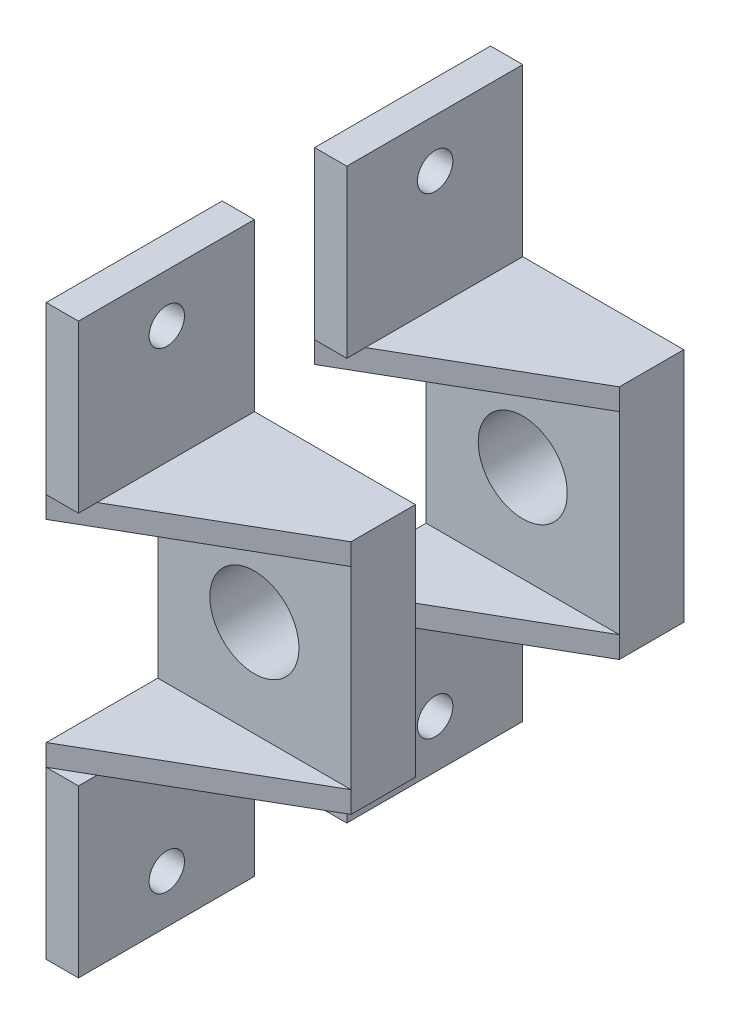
from build123d import *

# Parameters (mm, degrees)
CROQUIS1_W                 = 275.5
CROQUIS1_H                 = 200
CROQUIS1_R                 = 15.25
CROQUIS1_R_2               = 1.75
CROQUIS1_W_2               = 142
CROQUIS1_H_2               = 40
SALIENTE_EXTRUIR1_DEPTH    = 6
CROQUIS2_W                 = 6
CROQUIS2_H                 = 22
SALIENTE_EXTRUIR2_DEPTH    = 18
SALIENTE_EXTRUIR3_DEPTH    = 2
SALIENTE_EXTRUIR4_DEPTH    = 2
CROQUIS5_R                 = 4.15
CORTAR_EXTRUIR1_DEPTH      = 6
MATRIZL1_COUNT             = 2
MATRIZL1_PITCH             = 25
CROQUIS19_W                = 16.392304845
CROQUIS19_H                = 15.5
SALIENTE_EXTRUIR7_DEPTH    = 3
CORTAR_EXTRUIR2_DEPTH      = 191.332215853
CORTAR_EXTRUIR2_DEPTH_BACK = 191.332215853
CROQUIS20_R                = 1.65
CROQUIS22_W                = 268.062698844
CROQUIS22_H                = 197.570901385
SALIENTE_EXTRUIR9_DEPTH    = 6
CROQUIS24_W                = 324.894094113
CROQUIS24_H                = 225.136916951
CORTAR_EXTRUIR3_DEPTH      = 196.279523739


with BuildPart() as part:
    # Croquis1 → Saliente-Extruir1 (new body)
    with BuildSketch(Plane(origin=(0, 0, 0), x_dir=(0, 0, -1), z_dir=(1, 0, 0))):
        with Locations((13, 14.790199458)):
            Rectangle(CROQUIS1_W, CROQUIS1_H)
        with Locations((-64.5, 0)):
            Circle(CROQUIS1_R, mode=Mode.SUBTRACT)
        with Locations((138.75, 109.790199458)):
            Circle(CROQUIS1_R_2, mode=Mode.SUBTRACT)
        with Locations(Location((-112.75, 109.790199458, 0), (0, 0, 180))):
            Circle(CROQUIS1_R_2, mode=Mode.SUBTRACT)
        with Locations(Location((138.75, -80.209800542, 0), (0, 0, 180))):
            Circle(CROQUIS1_R_2, mode=Mode.SUBTRACT)
        with Locations((-112.75, -80.209800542)):
            Circle(CROQUIS1_R_2, mode=Mode.SUBTRACT)
        with BuildLine():
            Line((93, 15.25), (60.5, 15.25))
            ThreePointArc((60.5, 15.25), (45.25, 0), (60.5, -15.25))
            Line((60.5, -15.25), (93, -15.25))
            ThreePointArc((93, -15.25), (108.25, 0), (93, 15.25))
        make_face(mode=Mode.SUBTRACT)
        with Locations((6.5, 58)):
            Rectangle(CROQUIS1_W_2, CROQUIS1_H_2, mode=Mode.SUBTRACT)
        with BuildLine():
            Line((-73, 78), (-73, 38))
            ThreePointArc((-73, 38), (-71.25, 36.25), (-69.5, 38))
            Line((-69.5, 38), (-69.5, 78))
            ThreePointArc((-69.5, 78), (-71.25, 79.75), (-73, 78))
        make_face(mode=Mode.SUBTRACT)
        with BuildLine():
            Line((86, 78), (86, 38))
            ThreePointArc((86, 38), (84.25, 36.25), (82.5, 38))
            Line((82.5, 38), (82.5, 78))
            ThreePointArc((82.5, 78), (84.25, 79.75), (86, 78))
        make_face(mode=Mode.SUBTRACT)
        with BuildLine():
            Line((45.5, 17), (-48.61482931, 17))
            ThreePointArc((-48.61482931, 17), (-50.26482931, 15.35), (-48.61482931, 13.7))
            Line((-48.61482931, 13.7), (45.5, 13.7))
            ThreePointArc((45.5, 13.7), (47.15, 15.35), (45.5, 17))
        make_face(mode=Mode.SUBTRACT)
    extrude(amount=SALIENTE_EXTRUIR1_DEPTH)

    # Croquis2 → Saliente-Extruir2 (add)
    with BuildSketch(Plane(origin=(6, 0, 0), x_dir=(0, 0, -1), z_dir=(1, 0, 0))):
        with Locations((5, 0)):
            Rectangle(CROQUIS2_W, CROQUIS2_H)
    saliente_extruir2 = extrude(amount=SALIENTE_EXTRUIR2_DEPTH)

    # Croquis3 → Saliente-Extruir3 (add)
    with BuildSketch(Plane(origin=(0, 11, 0), x_dir=(1, 0, 0), z_dir=(0, 1, 0))):
        Polygon((6, -8.392304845), (24, 2), (6, 2), align=None)
    saliente_extruir3 = extrude(amount=-SALIENTE_EXTRUIR3_DEPTH)

    # Croquis4 → Saliente-Extruir4 (add)
    with BuildSketch(Plane(origin=(0, -11, 0), x_dir=(-1, 0, 0), z_dir=(0, -1, 0))):
        Polygon((-24, 2), (-6, -8.392304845), (-6, 2), align=None)
    saliente_extruir4 = extrude(amount=-SALIENTE_EXTRUIR4_DEPTH)

    # Croquis5 → Cortar-Extruir1 (cut)
    with BuildSketch(Plane(origin=(0, 0, -8), x_dir=(-1, 0, 0), z_dir=(0, 0, -1))):
        with Locations((-15, 0)):
            Circle(CROQUIS5_R)
    cortar_extruir1 = extrude(amount=-CORTAR_EXTRUIR1_DEPTH, mode=Mode.SUBTRACT)

    # MatrizL1: Saliente-Extruir2, Saliente-Extruir3, Saliente-Extruir4, Cortar-Extruir1 ×2
    with Locations(*[(0, 0, i * MATRIZL1_PITCH) for i in range(1, MATRIZL1_COUNT)]):
        add(saliente_extruir2)
        add(saliente_extruir3)
        add(saliente_extruir4)
        add(cortar_extruir1, mode=Mode.SUBTRACT)

    # Croquis19 → Saliente-Extruir7 (add)
    with BuildSketch(Plane(origin=(6, 0, 0), x_dir=(0, 0, -1), z_dir=(1, 0, 0))):
        with Locations((-0.196152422, -18.75)):
            Rectangle(CROQUIS19_W, CROQUIS19_H)
        with Locations((-25.196152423, -18.75)):
            Rectangle(CROQUIS19_W, CROQUIS19_H)
        with Locations((-25.196152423, 18.75)):
            Rectangle(CROQUIS19_W, CROQUIS19_H)
        with Locations((-0.196152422, 18.75)):
            Rectangle(CROQUIS19_W, CROQUIS19_H)
    extrude(amount=SALIENTE_EXTRUIR7_DEPTH)

    # Croquis20 → Cortar-Extruir2 (cut, two sides: drawn at the far end of the back side and taken through both)
    with BuildSketch(Plane(origin=(6, 0, 0), x_dir=(0, 0, -1), z_dir=(1, 0, 0)).offset(-CORTAR_EXTRUIR2_DEPTH_BACK)):
        with Locations((-0.160287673, -22)):
            Circle(CROQUIS20_R)
        with Locations((-25.160287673, -22)):
            Circle(CROQUIS20_R)
        with Locations((-25.160287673, 22)):
            Circle(CROQUIS20_R)
        with Locations((-0.160287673, 22)):
            Circle(CROQUIS20_R)
    extrude(amount=CORTAR_EXTRUIR2_DEPTH + CORTAR_EXTRUIR2_DEPTH_BACK, mode=Mode.SUBTRACT)

    # Croquis22 → Saliente-Extruir9 (add)
    with BuildSketch(Plane(origin=(0, 0, 0), x_dir=(0, 0, -1), z_dir=(1, 0, 0))):
        Polygon((-130.95, 14.790199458), (-130.95, 64.790199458), (-124.75, 64.790199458), (-124.75, 114.790199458), (-55.875, 114.790199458), (13, 114.790199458), (81.875, 114.790199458), (150.75, 114.790199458), (150.75, 64.790199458), (156.95, 64.790199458), (156.95, 14.790199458), (150.75, 14.790199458), (150.75, -35.209800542), (156.95, -35.209800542), (156.95, -85.209800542), (150.75, -85.209800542), (81.875, -85.209800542), (81.875, -91.409800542), (13, -91.409800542), (13, -85.209800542), (-55.875, -85.209800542), (-55.875, -91.409800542), (-124.75, -91.409800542), (-124.75, -85.209800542), (-130.95, -85.209800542), (-130.95, -35.209800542), (-124.75, -35.209800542), (-124.75, 14.790199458), align=None)
        with Locations((10.532356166, 14.603022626)):
            Rectangle(CROQUIS22_W, CROQUIS22_H, mode=Mode.SUBTRACT)
    extrude(amount=SALIENTE_EXTRUIR9_DEPTH)

    # Croquis24 → Cortar-Extruir3 (cut, through all)
    with BuildSketch(Plane(origin=(6, 0, 0), x_dir=(0, 0, -1), z_dir=(1, 0, 0))):
        with Locations((9.925292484, 12.544284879)):
            Rectangle(CROQUIS24_W, CROQUIS24_H)
    extrude(amount=-CORTAR_EXTRUIR3_DEPTH, mode=Mode.SUBTRACT)


with BuildPart() as cortar_extruir3_piece_1:
    # of the separate pieces the step leaves, piece 1, a body of its own (cortar_extruir3_pieces)
    add(part.part.solids().sort_by_distance((6, -22, -1.489712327))[0])


with BuildPart() as cortar_extruir3_piece_2:
    # of the separate pieces the step leaves, piece 2, a body of its own (cortar_extruir3_pieces)
    add(part.part.solids().sort_by_distance((6, -22, 23.510287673))[0])


solid = Compound([cortar_extruir3_piece_1.part, cortar_extruir3_piece_2.part])
